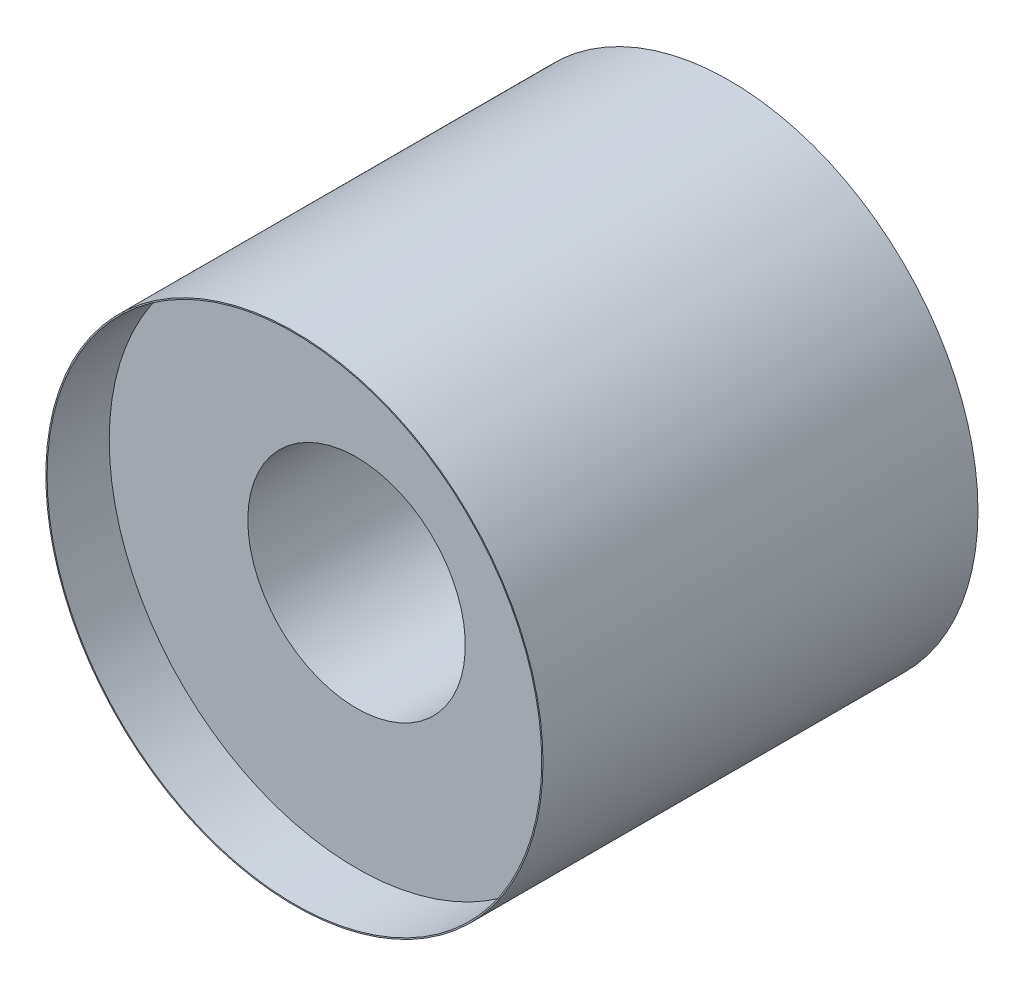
ISO-10303-21;
HEADER;
FILE_DESCRIPTION(('STEP AP214'),'2;1');
FILE_NAME('part.step','',(''),(''),'','','');
FILE_SCHEMA(('AUTOMOTIVE_DESIGN { 1 0 10303 214 1 1 1 1 }'));
ENDSEC;
DATA;
#1=APPLICATION_CONTEXT('core data for automotive mechanical design processes');
#2=APPLICATION_PROTOCOL_DEFINITION('international standard','automotive_design',2000,#1);
#3=PRODUCT_CONTEXT('',#1,'mechanical');
#4=PRODUCT('Part','Part','',(#3));
#5=PRODUCT_RELATED_PRODUCT_CATEGORY('part','',(#4));
#6=PRODUCT_DEFINITION_FORMATION('','',#4);
#7=PRODUCT_DEFINITION_CONTEXT('part definition',#1,'design');
#8=PRODUCT_DEFINITION('design','',#6,#7);
#9=PRODUCT_DEFINITION_SHAPE('','',#8);
#10=(LENGTH_UNIT() NAMED_UNIT(*) SI_UNIT(.MILLI.,.METRE.));
#11=(NAMED_UNIT(*) PLANE_ANGLE_UNIT() SI_UNIT($,.RADIAN.));
#12=(NAMED_UNIT(*) SI_UNIT($,.STERADIAN.) SOLID_ANGLE_UNIT());
#13=UNCERTAINTY_MEASURE_WITH_UNIT(LENGTH_MEASURE(1.E-05),#10,'distance_accuracy_value','');
#14=(GEOMETRIC_REPRESENTATION_CONTEXT(3) GLOBAL_UNCERTAINTY_ASSIGNED_CONTEXT((#13)) GLOBAL_UNIT_ASSIGNED_CONTEXT((#10,
#11,#12)) REPRESENTATION_CONTEXT('',''));
#15=CARTESIAN_POINT('',(0.,0.,0.));
#16=DIRECTION('',(0.,0.,1.));
#17=DIRECTION('',(1.,0.,0.));
#18=AXIS2_PLACEMENT_3D('',#15,#16,#17);
#19=CARTESIAN_POINT('',(0.,0.,44.45));
#20=DIRECTION('',(0.,0.,-1.));
#21=DIRECTION('',(-1.,0.,0.));
#22=AXIS2_PLACEMENT_3D('',#19,#20,#21);
#23=CYLINDRICAL_SURFACE('',#22,25.4);
#24=CARTESIAN_POINT('',(0.,0.,44.45));
#25=DIRECTION('',(0.,0.,1.));
#26=DIRECTION('',(1.,0.,0.));
#27=AXIS2_PLACEMENT_3D('',#24,#25,#26);
#28=CIRCLE('',#27,25.4);
#29=CARTESIAN_POINT('',(25.4,0.,44.45));
#30=VERTEX_POINT('',#29);
#31=EDGE_CURVE('E10',#30,#30,#28,.T.);
#32=ORIENTED_EDGE('',*,*,#31,.F.);
#33=EDGE_LOOP('',(#32));
#34=FACE_BOUND('',#33,.T.);
#35=CARTESIAN_POINT('',(0.,0.,0.));
#36=DIRECTION('',(0.,0.,1.));
#37=DIRECTION('',(1.,0.,0.));
#38=AXIS2_PLACEMENT_3D('',#35,#36,#37);
#39=CIRCLE('',#38,25.4);
#40=CARTESIAN_POINT('',(25.4,0.,0.));
#41=VERTEX_POINT('',#40);
#42=EDGE_CURVE('E33',#41,#41,#39,.T.);
#43=ORIENTED_EDGE('',*,*,#42,.T.);
#44=EDGE_LOOP('',(#43));
#45=FACE_BOUND('',#44,.T.);
#46=ADVANCED_FACE('F30',(#34,#45),#23,.T.);
#47=CARTESIAN_POINT('',(0.,0.,44.45));
#48=DIRECTION('',(0.,0.,1.));
#49=DIRECTION('',(1.,0.,0.));
#50=AXIS2_PLACEMENT_3D('',#47,#48,#49);
#51=PLANE('',#50);
#52=CARTESIAN_POINT('',(0.,0.,44.45));
#53=DIRECTION('',(0.,0.,1.));
#54=DIRECTION('',(1.,0.,0.));
#55=AXIS2_PLACEMENT_3D('',#52,#53,#54);
#56=CIRCLE('',#55,25.273);
#57=CARTESIAN_POINT('',(25.273,0.,44.45));
#58=VERTEX_POINT('',#57);
#59=EDGE_CURVE('E42',#58,#58,#56,.T.);
#60=ORIENTED_EDGE('',*,*,#59,.F.);
#61=EDGE_LOOP('',(#60));
#62=FACE_BOUND('',#61,.T.);
#63=ORIENTED_EDGE('',*,*,#31,.T.);
#64=EDGE_LOOP('',(#63));
#65=FACE_BOUND('',#64,.T.);
#66=ADVANCED_FACE('F85',(#62,#65),#51,.T.);
#67=CARTESIAN_POINT('',(0.,0.,0.));
#68=DIRECTION('',(0.,0.,1.));
#69=DIRECTION('',(1.,0.,0.));
#70=AXIS2_PLACEMENT_3D('',#67,#68,#69);
#71=PLANE('',#70);
#72=CARTESIAN_POINT('',(0.,0.,0.));
#73=DIRECTION('',(0.,0.,-1.));
#74=DIRECTION('',(-1.,0.,0.));
#75=AXIS2_PLACEMENT_3D('',#72,#73,#74);
#76=CIRCLE('',#75,25.273);
#77=CARTESIAN_POINT('',(-25.273,0.,0.));
#78=VERTEX_POINT('',#77);
#79=EDGE_CURVE('E48',#78,#78,#76,.T.);
#80=ORIENTED_EDGE('',*,*,#79,.F.);
#81=EDGE_LOOP('',(#80));
#82=FACE_BOUND('',#81,.T.);
#83=ORIENTED_EDGE('',*,*,#42,.F.);
#84=EDGE_LOOP('',(#83));
#85=FACE_BOUND('',#84,.T.);
#86=ADVANCED_FACE('F81',(#82,#85),#71,.F.);
#87=CARTESIAN_POINT('',(0.,0.,38.1));
#88=DIRECTION('',(0.,0.,1.));
#89=DIRECTION('',(1.,0.,0.));
#90=AXIS2_PLACEMENT_3D('',#87,#88,#89);
#91=CYLINDRICAL_SURFACE('',#90,25.273);
#92=CARTESIAN_POINT('',(0.,0.,38.1));
#93=DIRECTION('',(0.,0.,1.));
#94=DIRECTION('',(1.,0.,0.));
#95=AXIS2_PLACEMENT_3D('',#92,#93,#94);
#96=CIRCLE('',#95,25.273);
#97=CARTESIAN_POINT('',(25.273,0.,38.1));
#98=VERTEX_POINT('',#97);
#99=EDGE_CURVE('E40',#98,#98,#96,.T.);
#100=CARTESIAN_POINT('',(25.273,0.,38.1));
#101=CARTESIAN_POINT('',(25.273,0.,38.1661458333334));
#102=CARTESIAN_POINT('',(25.273,0.,38.2322916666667));
#103=CARTESIAN_POINT('',(25.273,0.,38.3645833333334));
#104=CARTESIAN_POINT('',(25.273,0.,38.4307291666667));
#105=CARTESIAN_POINT('',(25.273,0.,38.5630208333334));
#106=CARTESIAN_POINT('',(25.273,0.,38.6291666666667));
#107=CARTESIAN_POINT('',(25.273,0.,38.7614583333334));
#108=CARTESIAN_POINT('',(25.273,0.,38.8276041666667));
#109=CARTESIAN_POINT('',(25.273,0.,38.9598958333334));
#110=CARTESIAN_POINT('',(25.273,0.,39.0260416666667));
#111=CARTESIAN_POINT('',(25.273,0.,39.1583333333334));
#112=CARTESIAN_POINT('',(25.273,0.,39.2244791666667));
#113=CARTESIAN_POINT('',(25.273,0.,39.3567708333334));
#114=CARTESIAN_POINT('',(25.273,0.,39.4229166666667));
#115=CARTESIAN_POINT('',(25.273,0.,39.5552083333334));
#116=CARTESIAN_POINT('',(25.273,0.,39.6213541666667));
#117=CARTESIAN_POINT('',(25.273,0.,39.7536458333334));
#118=CARTESIAN_POINT('',(25.273,0.,39.8197916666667));
#119=CARTESIAN_POINT('',(25.273,0.,39.9520833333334));
#120=CARTESIAN_POINT('',(25.273,0.,40.0182291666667));
#121=CARTESIAN_POINT('',(25.273,0.,40.1505208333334));
#122=CARTESIAN_POINT('',(25.273,0.,40.2166666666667));
#123=CARTESIAN_POINT('',(25.273,0.,40.3489583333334));
#124=CARTESIAN_POINT('',(25.273,0.,40.4151041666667));
#125=CARTESIAN_POINT('',(25.273,0.,40.5473958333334));
#126=CARTESIAN_POINT('',(25.273,0.,40.6135416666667));
#127=CARTESIAN_POINT('',(25.273,0.,40.7458333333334));
#128=CARTESIAN_POINT('',(25.273,0.,40.8119791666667));
#129=CARTESIAN_POINT('',(25.273,0.,40.9442708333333));
#130=CARTESIAN_POINT('',(25.273,0.,41.0104166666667));
#131=CARTESIAN_POINT('',(25.273,0.,41.1427083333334));
#132=CARTESIAN_POINT('',(25.273,0.,41.2088541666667));
#133=CARTESIAN_POINT('',(25.273,0.,41.3411458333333));
#134=CARTESIAN_POINT('',(25.273,0.,41.4072916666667));
#135=CARTESIAN_POINT('',(25.273,0.,41.5395833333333));
#136=CARTESIAN_POINT('',(25.273,0.,41.6057291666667));
#137=CARTESIAN_POINT('',(25.273,0.,41.7380208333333));
#138=CARTESIAN_POINT('',(25.273,0.,41.8041666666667));
#139=CARTESIAN_POINT('',(25.273,0.,41.9364583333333));
#140=CARTESIAN_POINT('',(25.273,0.,42.0026041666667));
#141=CARTESIAN_POINT('',(25.273,0.,42.1348958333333));
#142=CARTESIAN_POINT('',(25.273,0.,42.2010416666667));
#143=CARTESIAN_POINT('',(25.273,0.,42.3333333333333));
#144=CARTESIAN_POINT('',(25.273,0.,42.3994791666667));
#145=CARTESIAN_POINT('',(25.273,0.,42.5317708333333));
#146=CARTESIAN_POINT('',(25.273,0.,42.5979166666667));
#147=CARTESIAN_POINT('',(25.273,0.,42.7302083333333));
#148=CARTESIAN_POINT('',(25.273,0.,42.7963541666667));
#149=CARTESIAN_POINT('',(25.273,0.,42.9286458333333));
#150=CARTESIAN_POINT('',(25.273,0.,42.9947916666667));
#151=CARTESIAN_POINT('',(25.273,0.,43.1270833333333));
#152=CARTESIAN_POINT('',(25.273,0.,43.1932291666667));
#153=CARTESIAN_POINT('',(25.273,0.,43.3255208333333));
#154=CARTESIAN_POINT('',(25.273,0.,43.3916666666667));
#155=CARTESIAN_POINT('',(25.273,0.,43.5239583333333));
#156=CARTESIAN_POINT('',(25.273,0.,43.5901041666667));
#157=CARTESIAN_POINT('',(25.273,0.,43.7223958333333));
#158=CARTESIAN_POINT('',(25.273,0.,43.7885416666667));
#159=CARTESIAN_POINT('',(25.273,0.,43.9208333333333));
#160=CARTESIAN_POINT('',(25.273,0.,43.9869791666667));
#161=CARTESIAN_POINT('',(25.273,0.,44.1192708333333));
#162=CARTESIAN_POINT('',(25.273,0.,44.1854166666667));
#163=CARTESIAN_POINT('',(25.273,0.,44.3177083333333));
#164=CARTESIAN_POINT('',(25.273,0.,44.3838541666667));
#165=CARTESIAN_POINT('',(25.273,0.,44.45));
#166=B_SPLINE_CURVE_WITH_KNOTS('',3,(#100,#101,#102,#103,#104,#105,#106,#107,#108,#109,#110,
#111,#112,#113,#114,#115,#116,#117,#118,#119,#120,#121,#122,#123,#124,#125,#126,#127,#128,#129,
#130,#131,#132,#133,#134,#135,#136,#137,#138,#139,#140,#141,#142,#143,#144,#145,#146,#147,#148,
#149,#150,#151,#152,#153,#154,#155,#156,#157,#158,#159,#160,#161,#162,#163,#164,#165),
.UNSPECIFIED.,.F.,.F.,(4,2,2,2,2,2,2,2,2,2,2,2,2,2,2,2,2,2,2,2,2,2,2,2,2,2,2,2,2,2,2,2,4),(0.,
0.198437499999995,0.396874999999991,0.595312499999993,0.793749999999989,0.992187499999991,
1.19062499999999,1.38906249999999,1.58749999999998,1.78593749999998,1.98437499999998,
2.18281249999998,2.38124999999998,2.57968749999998,2.77812499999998,2.97656249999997,
3.17499999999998,3.37343749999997,3.57187499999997,3.77031249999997,3.96874999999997,
4.16718749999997,4.36562499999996,4.56406249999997,4.76249999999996,4.96093749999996,
5.15937499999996,5.35781249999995,5.55624999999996,5.75468749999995,5.95312499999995,
6.15156249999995,6.34999999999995),.UNSPECIFIED.);
#167=EDGE_CURVE('BSEAM84',#98,#58,#166,.T.);
#168=ORIENTED_EDGE('',*,*,#99,.F.);
#169=ORIENTED_EDGE('',*,*,#59,.T.);
#170=ORIENTED_EDGE('',*,*,#167,.T.);
#171=ORIENTED_EDGE('',*,*,#167,.F.);
#172=EDGE_LOOP('',(#168,#170,#169,#171));
#173=FACE_BOUND('',#172,.T.);
#174=ADVANCED_FACE('F84',(#173),#91,.F.);
#175=CARTESIAN_POINT('',(0.,0.,38.1));
#176=DIRECTION('',(0.,0.,1.));
#177=DIRECTION('',(1.,0.,0.));
#178=AXIS2_PLACEMENT_3D('',#175,#176,#177);
#179=PLANE('',#178);
#180=CARTESIAN_POINT('',(0.,0.,38.1));
#181=DIRECTION('',(0.,0.,-1.));
#182=DIRECTION('',(-1.,0.,0.));
#183=AXIS2_PLACEMENT_3D('',#180,#181,#182);
#184=CIRCLE('',#183,11.1125);
#185=CARTESIAN_POINT('',(-11.1125,0.,38.1));
#186=VERTEX_POINT('',#185);
#187=EDGE_CURVE('E51',#186,#186,#184,.T.);
#188=ORIENTED_EDGE('',*,*,#187,.T.);
#189=EDGE_LOOP('',(#188));
#190=FACE_BOUND('',#189,.T.);
#191=ORIENTED_EDGE('',*,*,#99,.T.);
#192=EDGE_LOOP('',(#191));
#193=FACE_BOUND('',#192,.T.);
#194=ADVANCED_FACE('F60',(#190,#193),#179,.T.);
#195=CARTESIAN_POINT('',(0.,0.,6.34999999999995));
#196=DIRECTION('',(0.,0.,-1.));
#197=DIRECTION('',(-1.,0.,0.));
#198=AXIS2_PLACEMENT_3D('',#195,#196,#197);
#199=CYLINDRICAL_SURFACE('',#198,25.273);
#200=CARTESIAN_POINT('',(0.,0.,6.34999999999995));
#201=DIRECTION('',(0.,0.,-1.));
#202=DIRECTION('',(-1.,0.,0.));
#203=AXIS2_PLACEMENT_3D('',#200,#201,#202);
#204=CIRCLE('',#203,25.273);
#205=CARTESIAN_POINT('',(-25.273,0.,6.34999999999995));
#206=VERTEX_POINT('',#205);
#207=EDGE_CURVE('E45',#206,#206,#204,.T.);
#208=CARTESIAN_POINT('',(-25.273,0.,6.34999999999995));
#209=CARTESIAN_POINT('',(-25.273,0.,6.28385416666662));
#210=CARTESIAN_POINT('',(-25.273,0.,6.21770833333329));
#211=CARTESIAN_POINT('',(-25.273,0.,6.08541666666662));
#212=CARTESIAN_POINT('',(-25.273,0.,6.01927083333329));
#213=CARTESIAN_POINT('',(-25.273,0.,5.88697916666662));
#214=CARTESIAN_POINT('',(-25.273,0.,5.82083333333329));
#215=CARTESIAN_POINT('',(-25.273,0.,5.68854166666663));
#216=CARTESIAN_POINT('',(-25.273,0.,5.62239583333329));
#217=CARTESIAN_POINT('',(-25.273,0.,5.49010416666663));
#218=CARTESIAN_POINT('',(-25.273,0.,5.4239583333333));
#219=CARTESIAN_POINT('',(-25.273,0.,5.29166666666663));
#220=CARTESIAN_POINT('',(-25.273,0.,5.2255208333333));
#221=CARTESIAN_POINT('',(-25.273,0.,5.09322916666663));
#222=CARTESIAN_POINT('',(-25.273,0.,5.0270833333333));
#223=CARTESIAN_POINT('',(-25.273,0.,4.89479166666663));
#224=CARTESIAN_POINT('',(-25.273,0.,4.8286458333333));
#225=CARTESIAN_POINT('',(-25.273,0.,4.69635416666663));
#226=CARTESIAN_POINT('',(-25.273,0.,4.6302083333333));
#227=CARTESIAN_POINT('',(-25.273,0.,4.49791666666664));
#228=CARTESIAN_POINT('',(-25.273,0.,4.4317708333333));
#229=CARTESIAN_POINT('',(-25.273,0.,4.29947916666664));
#230=CARTESIAN_POINT('',(-25.273,0.,4.2333333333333));
#231=CARTESIAN_POINT('',(-25.273,0.,4.10104166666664));
#232=CARTESIAN_POINT('',(-25.273,0.,4.03489583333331));
#233=CARTESIAN_POINT('',(-25.273,0.,3.90260416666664));
#234=CARTESIAN_POINT('',(-25.273,0.,3.83645833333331));
#235=CARTESIAN_POINT('',(-25.273,0.,3.70416666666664));
#236=CARTESIAN_POINT('',(-25.273,0.,3.63802083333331));
#237=CARTESIAN_POINT('',(-25.273,0.,3.50572916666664));
#238=CARTESIAN_POINT('',(-25.273,0.,3.43958333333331));
#239=CARTESIAN_POINT('',(-25.273,0.,3.30729166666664));
#240=CARTESIAN_POINT('',(-25.273,0.,3.24114583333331));
#241=CARTESIAN_POINT('',(-25.273,0.,3.10885416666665));
#242=CARTESIAN_POINT('',(-25.273,0.,3.04270833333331));
#243=CARTESIAN_POINT('',(-25.273,0.,2.91041666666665));
#244=CARTESIAN_POINT('',(-25.273,0.,2.84427083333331));
#245=CARTESIAN_POINT('',(-25.273,0.,2.71197916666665));
#246=CARTESIAN_POINT('',(-25.273,0.,2.64583333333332));
#247=CARTESIAN_POINT('',(-25.273,0.,2.51354166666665));
#248=CARTESIAN_POINT('',(-25.273,0.,2.44739583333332));
#249=CARTESIAN_POINT('',(-25.273,0.,2.31510416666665));
#250=CARTESIAN_POINT('',(-25.273,0.,2.24895833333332));
#251=CARTESIAN_POINT('',(-25.273,0.,2.11666666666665));
#252=CARTESIAN_POINT('',(-25.273,0.,2.05052083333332));
#253=CARTESIAN_POINT('',(-25.273,0.,1.91822916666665));
#254=CARTESIAN_POINT('',(-25.273,0.,1.85208333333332));
#255=CARTESIAN_POINT('',(-25.273,0.,1.71979166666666));
#256=CARTESIAN_POINT('',(-25.273,0.,1.65364583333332));
#257=CARTESIAN_POINT('',(-25.273,0.,1.52135416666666));
#258=CARTESIAN_POINT('',(-25.273,0.,1.45520833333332));
#259=CARTESIAN_POINT('',(-25.273,0.,1.32291666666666));
#260=CARTESIAN_POINT('',(-25.273,0.,1.25677083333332));
#261=CARTESIAN_POINT('',(-25.273,0.,1.12447916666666));
#262=CARTESIAN_POINT('',(-25.273,0.,1.05833333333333));
#263=CARTESIAN_POINT('',(-25.273,0.,0.926041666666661));
#264=CARTESIAN_POINT('',(-25.273,0.,0.859895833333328));
#265=CARTESIAN_POINT('',(-25.273,0.,0.727604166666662));
#266=CARTESIAN_POINT('',(-25.273,0.,0.66145833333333));
#267=CARTESIAN_POINT('',(-25.273,0.,0.529166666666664));
#268=CARTESIAN_POINT('',(-25.273,0.,0.463020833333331));
#269=CARTESIAN_POINT('',(-25.273,0.,0.330729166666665));
#270=CARTESIAN_POINT('',(-25.273,0.,0.264583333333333));
#271=CARTESIAN_POINT('',(-25.273,0.,0.132291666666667));
#272=CARTESIAN_POINT('',(-25.273,0.,0.0661458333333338));
#273=CARTESIAN_POINT('',(-25.273,0.,0.));
#274=B_SPLINE_CURVE_WITH_KNOTS('',3,(#208,#209,#210,#211,#212,#213,#214,#215,#216,#217,#218,
#219,#220,#221,#222,#223,#224,#225,#226,#227,#228,#229,#230,#231,#232,#233,#234,#235,#236,#237,
#238,#239,#240,#241,#242,#243,#244,#245,#246,#247,#248,#249,#250,#251,#252,#253,#254,#255,#256,
#257,#258,#259,#260,#261,#262,#263,#264,#265,#266,#267,#268,#269,#270,#271,#272,#273),
.UNSPECIFIED.,.F.,.F.,(4,2,2,2,2,2,2,2,2,2,2,2,2,2,2,2,2,2,2,2,2,2,2,2,2,2,2,2,2,2,2,2,4),(0.,
0.198437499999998,0.396874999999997,0.595312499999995,0.793749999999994,0.992187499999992,
1.19062499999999,1.38906249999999,1.58749999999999,1.78593749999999,1.98437499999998,
2.18281249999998,2.38124999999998,2.57968749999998,2.77812499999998,2.97656249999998,
3.17499999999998,3.37343749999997,3.57187499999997,3.77031249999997,3.96874999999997,
4.16718749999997,4.36562499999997,4.56406249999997,4.76249999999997,4.96093749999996,
5.15937499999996,5.35781249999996,5.55624999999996,5.75468749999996,5.95312499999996,
6.15156249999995,6.34999999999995),.UNSPECIFIED.);
#275=EDGE_CURVE('BSEAM72',#206,#78,#274,.T.);
#276=ORIENTED_EDGE('',*,*,#207,.F.);
#277=ORIENTED_EDGE('',*,*,#79,.T.);
#278=ORIENTED_EDGE('',*,*,#275,.T.);
#279=ORIENTED_EDGE('',*,*,#275,.F.);
#280=EDGE_LOOP('',(#276,#278,#277,#279));
#281=FACE_BOUND('',#280,.T.);
#282=ADVANCED_FACE('F72',(#281),#199,.F.);
#283=CARTESIAN_POINT('',(0.,0.,6.34999999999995));
#284=DIRECTION('',(0.,0.,-1.));
#285=DIRECTION('',(-1.,0.,0.));
#286=AXIS2_PLACEMENT_3D('',#283,#284,#285);
#287=PLANE('',#286);
#288=CARTESIAN_POINT('',(0.,0.,6.34999999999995));
#289=DIRECTION('',(0.,0.,-1.));
#290=DIRECTION('',(-1.,0.,0.));
#291=AXIS2_PLACEMENT_3D('',#288,#289,#290);
#292=CIRCLE('',#291,11.1125);
#293=CARTESIAN_POINT('',(-11.1125,0.,6.34999999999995));
#294=VERTEX_POINT('',#293);
#295=EDGE_CURVE('E54',#294,#294,#292,.T.);
#296=ORIENTED_EDGE('',*,*,#295,.F.);
#297=EDGE_LOOP('',(#296));
#298=FACE_BOUND('',#297,.T.);
#299=ORIENTED_EDGE('',*,*,#207,.T.);
#300=EDGE_LOOP('',(#299));
#301=FACE_BOUND('',#300,.T.);
#302=ADVANCED_FACE('F66',(#298,#301),#287,.T.);
#303=CARTESIAN_POINT('',(0.,0.,38.1));
#304=DIRECTION('',(0.,0.,-1.));
#305=DIRECTION('',(-1.,0.,0.));
#306=AXIS2_PLACEMENT_3D('',#303,#304,#305);
#307=CYLINDRICAL_SURFACE('',#306,11.1125);
#308=ORIENTED_EDGE('',*,*,#187,.F.);
#309=EDGE_LOOP('',(#308));
#310=FACE_BOUND('',#309,.T.);
#311=ORIENTED_EDGE('',*,*,#295,.T.);
#312=EDGE_LOOP('',(#311));
#313=FACE_BOUND('',#312,.T.);
#314=ADVANCED_FACE('F63',(#310,#313),#307,.F.);
#315=CLOSED_SHELL('',(#46,#66,#86,#174,#194,#282,#302,#314));
#316=MANIFOLD_SOLID_BREP('B2',#315);
#317=ADVANCED_BREP_SHAPE_REPRESENTATION('',(#18,#316),#14);
#318=SHAPE_DEFINITION_REPRESENTATION(#9,#317);
ENDSEC;
END-ISO-10303-21;
